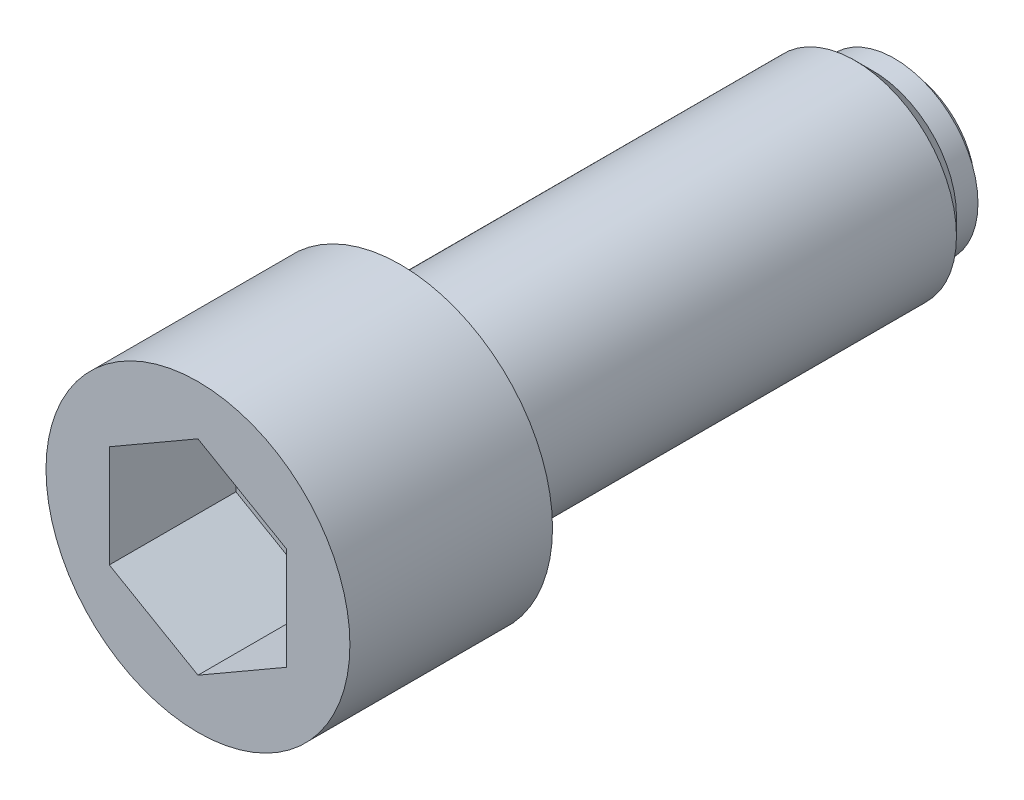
ISO-10303-21;
HEADER;
FILE_DESCRIPTION(('STEP AP214'),'2;1');
FILE_NAME('part.step','',(''),(''),'','','');
FILE_SCHEMA(('AUTOMOTIVE_DESIGN { 1 0 10303 214 1 1 1 1 }'));
ENDSEC;
DATA;
#1=APPLICATION_CONTEXT('core data for automotive mechanical design processes');
#2=APPLICATION_PROTOCOL_DEFINITION('international standard','automotive_design',2000,#1);
#3=PRODUCT_CONTEXT('',#1,'mechanical');
#4=PRODUCT('Part','Part','',(#3));
#5=PRODUCT_RELATED_PRODUCT_CATEGORY('part','',(#4));
#6=PRODUCT_DEFINITION_FORMATION('','',#4);
#7=PRODUCT_DEFINITION_CONTEXT('part definition',#1,'design');
#8=PRODUCT_DEFINITION('design','',#6,#7);
#9=PRODUCT_DEFINITION_SHAPE('','',#8);
#10=(LENGTH_UNIT() NAMED_UNIT(*) SI_UNIT(.MILLI.,.METRE.));
#11=(NAMED_UNIT(*) PLANE_ANGLE_UNIT() SI_UNIT($,.RADIAN.));
#12=(NAMED_UNIT(*) SI_UNIT($,.STERADIAN.) SOLID_ANGLE_UNIT());
#13=UNCERTAINTY_MEASURE_WITH_UNIT(LENGTH_MEASURE(1.E-05),#10,'distance_accuracy_value','');
#14=(GEOMETRIC_REPRESENTATION_CONTEXT(3) GLOBAL_UNCERTAINTY_ASSIGNED_CONTEXT((#13)) GLOBAL_UNIT_ASSIGNED_CONTEXT((#10,
#11,#12)) REPRESENTATION_CONTEXT('',''));
#15=CARTESIAN_POINT('',(0.,0.,0.));
#16=DIRECTION('',(0.,0.,1.));
#17=DIRECTION('',(1.,0.,0.));
#18=AXIS2_PLACEMENT_3D('',#15,#16,#17);
#19=CARTESIAN_POINT('',(0.,0.,2.71615537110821));
#20=DIRECTION('',(0.,0.,1.));
#21=DIRECTION('',(-1.,0.,0.));
#22=AXIS2_PLACEMENT_3D('',#19,#20,#21);
#23=SPHERICAL_SURFACE('',#22,6.);
#24=CARTESIAN_POINT('',(0.,0.,1.));
#25=DIRECTION('',(0.,0.,1.));
#26=DIRECTION('',(1.,0.,0.));
#27=AXIS2_PLACEMENT_3D('',#24,#25,#26);
#28=CIRCLE('',#27,5.74933133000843);
#29=CARTESIAN_POINT('',(-5.74933133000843,0.,1.));
#30=VERTEX_POINT('',#29);
#31=EDGE_CURVE('E132',#30,#30,#28,.T.);
#32=CARTESIAN_POINT('',(0.,0.,0.));
#33=DIRECTION('',(0.,0.,1.));
#34=DIRECTION('',(1.,0.,0.));
#35=AXIS2_PLACEMENT_3D('',#32,#33,#34);
#36=CIRCLE('',#35,5.35);
#37=CARTESIAN_POINT('',(-5.35000000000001,0.,0.));
#38=VERTEX_POINT('',#37);
#39=EDGE_CURVE('E10',#38,#38,#36,.T.);
#40=CARTESIAN_POINT('',(-5.74933133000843,0.,1.));
#41=CARTESIAN_POINT('',(-5.74611879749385,0.,0.989237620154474));
#42=CARTESIAN_POINT('',(-5.74287604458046,0.,0.978484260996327));
#43=CARTESIAN_POINT('',(-5.73633020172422,0.,0.956995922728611));
#44=CARTESIAN_POINT('',(-5.73302711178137,0.,0.946260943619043));
#45=CARTESIAN_POINT('',(-5.72636069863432,0.,0.924809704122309));
#46=CARTESIAN_POINT('',(-5.72299737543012,0.,0.914093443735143));
#47=CARTESIAN_POINT('',(-5.71621060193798,0.,0.892679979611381));
#48=CARTESIAN_POINT('',(-5.71278715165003,0.,0.881982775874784));
#49=CARTESIAN_POINT('',(-5.7058802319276,0.,0.860607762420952));
#50=CARTESIAN_POINT('',(-5.70239676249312,0.,0.849929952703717));
#51=CARTESIAN_POINT('',(-5.69536991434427,0.,0.828594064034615));
#52=CARTESIAN_POINT('',(-5.6918265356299,0.,0.817935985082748));
#53=CARTESIAN_POINT('',(-5.68467998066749,0.,0.796639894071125));
#54=CARTESIAN_POINT('',(-5.68107680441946,0.,0.786001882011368));
#55=CARTESIAN_POINT('',(-5.67381076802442,0.,0.764746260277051));
#56=CARTESIAN_POINT('',(-5.67014790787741,0.,0.75412865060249));
#57=CARTESIAN_POINT('',(-5.66276261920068,0.,0.732914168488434));
#58=CARTESIAN_POINT('',(-5.65904019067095,0.,0.722317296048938));
#59=CARTESIAN_POINT('',(-5.65153588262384,0.,0.701144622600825));
#60=CARTESIAN_POINT('',(-5.64775400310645,0.,0.690568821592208));
#61=CARTESIAN_POINT('',(-5.64013091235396,0.,0.66943862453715));
#62=CARTESIAN_POINT('',(-5.63628970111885,0.,0.658884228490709));
#63=CARTESIAN_POINT('',(-5.628548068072,0.,0.637797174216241));
#64=CARTESIAN_POINT('',(-5.62464764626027,0.,0.627264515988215));
#65=CARTESIAN_POINT('',(-5.61678771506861,0.,0.606221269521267));
#66=CARTESIAN_POINT('',(-5.61282820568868,0.,0.595710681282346));
#67=CARTESIAN_POINT('',(-5.60485022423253,0.,0.574711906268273));
#68=CARTESIAN_POINT('',(-5.6008317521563,0.,0.564223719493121));
#69=CARTESIAN_POINT('',(-5.59273597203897,0.,0.54327007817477));
#70=CARTESIAN_POINT('',(-5.58865866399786,0.,0.532804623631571));
#71=CARTESIAN_POINT('',(-5.58044534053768,0.,0.5118967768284));
#72=CARTESIAN_POINT('',(-5.57630932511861,0.,0.501454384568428));
#73=CARTESIAN_POINT('',(-5.56797871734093,0.,0.480592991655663));
#74=CARTESIAN_POINT('',(-5.56378412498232,0.,0.47017399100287));
#75=CARTESIAN_POINT('',(-5.55533649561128,0.,0.449359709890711));
#76=CARTESIAN_POINT('',(-5.55108345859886,0.,0.438964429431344));
#77=CARTESIAN_POINT('',(-5.54251907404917,0.,0.418197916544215));
#78=CARTESIAN_POINT('',(-5.53820772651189,0.,0.407826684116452));
#79=CARTESIAN_POINT('',(-5.52952685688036,0.,0.387108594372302));
#80=CARTESIAN_POINT('',(-5.52515733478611,0.,0.376761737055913));
#81=CARTESIAN_POINT('',(-5.51636025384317,0.,0.356092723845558));
#82=CARTESIAN_POINT('',(-5.51193269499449,0.,0.345770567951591));
#83=CARTESIAN_POINT('',(-5.50301968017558,0.,0.325151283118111));
#84=CARTESIAN_POINT('',(-5.49853422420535,0.,0.314854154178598));
#85=CARTESIAN_POINT('',(-5.4895055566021,0.,0.294285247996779));
#86=CARTESIAN_POINT('',(-5.48496234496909,0.,0.284013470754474));
#87=CARTESIAN_POINT('',(-5.47581830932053,0.,0.263495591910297));
#88=CARTESIAN_POINT('',(-5.47121748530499,0.,0.253249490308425));
#89=CARTESIAN_POINT('',(-5.4619583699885,0.,0.232783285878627));
#90=CARTESIAN_POINT('',(-5.45730007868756,0.,0.222563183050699));
#91=CARTESIAN_POINT('',(-5.44792617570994,0.,0.202149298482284));
#92=CARTESIAN_POINT('',(-5.44321056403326,0.,0.191955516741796));
#93=CARTESIAN_POINT('',(-5.4337221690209,0.,0.171594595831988));
#94=CARTESIAN_POINT('',(-5.42894938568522,0.,0.161427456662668));
#95=CARTESIAN_POINT('',(-5.41934679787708,0.,0.141120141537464));
#96=CARTESIAN_POINT('',(-5.41451699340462,0.,0.13097996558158));
#97=CARTESIAN_POINT('',(-5.40480051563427,0.,0.110726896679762));
#98=CARTESIAN_POINT('',(-5.39991384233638,0.,0.100614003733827));
#99=CARTESIAN_POINT('',(-5.3900837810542,0.,0.0804158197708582));
#100=CARTESIAN_POINT('',(-5.38514039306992,0.,0.0703305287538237));
#101=CARTESIAN_POINT('',(-5.37519705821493,0.,0.050187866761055));
#102=CARTESIAN_POINT('',(-5.37019711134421,0.,0.0401304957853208));
#103=CARTESIAN_POINT('',(-5.36014081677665,0.,0.0200439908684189));
#104=CARTESIAN_POINT('',(-5.3550844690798,0.,0.0100148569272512));
#105=CARTESIAN_POINT('',(-5.35000000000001,0.,0.));
#106=B_SPLINE_CURVE_WITH_KNOTS('',3,(#40,#41,#42,#43,#44,#45,#46,#47,#48,#49,#50,#51,#52,#53,
#54,#55,#56,#57,#58,#59,#60,#61,#62,#63,#64,#65,#66,#67,#68,#69,#70,#71,#72,#73,#74,#75,#76,#77,
#78,#79,#80,#81,#82,#83,#84,#85,#86,#87,#88,#89,#90,#91,#92,#93,#94,#95,#96,#97,#98,#99,#100,
#101,#102,#103,#104,#105),.UNSPECIFIED.,.F.,.F.,(4,2,2,2,2,2,2,2,2,2,2,2,2,2,2,2,2,2,2,2,2,2,2,
2,2,2,2,2,2,2,2,2,4),(0.,0.033694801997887,0.0673896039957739,0.101084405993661,
0.134779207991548,0.168474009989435,0.202168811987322,0.235863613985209,0.269558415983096,
0.303253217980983,0.33694801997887,0.370642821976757,0.404337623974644,0.438032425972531,
0.471727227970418,0.505422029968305,0.539116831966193,0.572811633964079,0.606506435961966,
0.640201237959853,0.67389603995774,0.707590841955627,0.741285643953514,0.774980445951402,
0.808675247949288,0.842370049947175,0.876064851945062,0.909759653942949,0.943454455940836,
0.977149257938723,1.01084405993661,1.0445388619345,1.07823366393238),.UNSPECIFIED.);
#107=EDGE_CURVE('BSEAM16',#30,#38,#106,.T.);
#108=ORIENTED_EDGE('',*,*,#31,.F.);
#109=ORIENTED_EDGE('',*,*,#39,.T.);
#110=ORIENTED_EDGE('',*,*,#107,.T.);
#111=ORIENTED_EDGE('',*,*,#107,.F.);
#112=EDGE_LOOP('',(#108,#110,#109,#111));
#113=FACE_BOUND('',#112,.T.);
#114=ADVANCED_FACE('F16',(#113),#23,.T.);
#115=CARTESIAN_POINT('',(0.,0.,0.));
#116=DIRECTION('',(0.,0.,1.));
#117=DIRECTION('',(1.,0.,0.));
#118=AXIS2_PLACEMENT_3D('',#115,#116,#117);
#119=PLANE('',#118);
#120=ORIENTED_EDGE('',*,*,#39,.F.);
#121=EDGE_LOOP('',(#120));
#122=FACE_BOUND('',#121,.T.);
#123=ADVANCED_FACE('F209',(#122),#119,.F.);
#124=CARTESIAN_POINT('',(-12.,0.,56.));
#125=DIRECTION('',(0.,0.,-1.));
#126=DIRECTION('',(-1.,0.,0.));
#127=AXIS2_PLACEMENT_3D('',#124,#125,#126);
#128=PLANE('',#127);
#129=DIRECTION('',(-0.866025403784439,-0.5,0.));
#130=VECTOR('',#129,1.);
#131=CARTESIAN_POINT('',(0.,8.08290376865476,56.));
#132=LINE('',#131,#130);
#133=CARTESIAN_POINT('',(0.,8.08290376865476,56.));
#134=VERTEX_POINT('',#133);
#135=CARTESIAN_POINT('',(-7.,4.04145188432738,56.));
#136=VERTEX_POINT('',#135);
#137=EDGE_CURVE('E114',#134,#136,#132,.T.);
#138=ORIENTED_EDGE('',*,*,#137,.F.);
#139=DIRECTION('',(-0.866025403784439,0.5,0.));
#140=VECTOR('',#139,1.);
#141=CARTESIAN_POINT('',(7.,4.04145188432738,56.));
#142=LINE('',#141,#140);
#143=CARTESIAN_POINT('',(7.,4.04145188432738,56.));
#144=VERTEX_POINT('',#143);
#145=EDGE_CURVE('E31',#144,#134,#142,.T.);
#146=ORIENTED_EDGE('',*,*,#145,.F.);
#147=DIRECTION('',(0.,1.,0.));
#148=VECTOR('',#147,1.);
#149=CARTESIAN_POINT('',(7.,-4.04145188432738,56.));
#150=LINE('',#149,#148);
#151=CARTESIAN_POINT('',(7.,-4.04145188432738,56.));
#152=VERTEX_POINT('',#151);
#153=EDGE_CURVE('E126',#152,#144,#150,.T.);
#154=ORIENTED_EDGE('',*,*,#153,.F.);
#155=DIRECTION('',(0.866025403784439,0.5,0.));
#156=VECTOR('',#155,1.);
#157=CARTESIAN_POINT('',(0.,-8.08290376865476,56.));
#158=LINE('',#157,#156);
#159=CARTESIAN_POINT('',(0.,-8.08290376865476,56.));
#160=VERTEX_POINT('',#159);
#161=EDGE_CURVE('E123',#160,#152,#158,.T.);
#162=ORIENTED_EDGE('',*,*,#161,.F.);
#163=DIRECTION('',(0.866025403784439,-0.5,0.));
#164=VECTOR('',#163,1.);
#165=CARTESIAN_POINT('',(-7.,-4.04145188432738,56.));
#166=LINE('',#165,#164);
#167=CARTESIAN_POINT('',(-7.,-4.04145188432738,56.));
#168=VERTEX_POINT('',#167);
#169=EDGE_CURVE('E79',#168,#160,#166,.T.);
#170=ORIENTED_EDGE('',*,*,#169,.F.);
#171=DIRECTION('',(0.,-1.,0.));
#172=VECTOR('',#171,1.);
#173=CARTESIAN_POINT('',(-7.,4.04145188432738,56.));
#174=LINE('',#173,#172);
#175=EDGE_CURVE('E118',#136,#168,#174,.T.);
#176=ORIENTED_EDGE('',*,*,#175,.F.);
#177=EDGE_LOOP('',(#138,#146,#154,#162,#170,#176));
#178=FACE_BOUND('',#177,.T.);
#179=CARTESIAN_POINT('',(0.,0.,56.));
#180=DIRECTION('',(0.,0.,1.));
#181=DIRECTION('',(1.,0.,0.));
#182=AXIS2_PLACEMENT_3D('',#179,#180,#181);
#183=CIRCLE('',#182,12.);
#184=CARTESIAN_POINT('',(12.,0.,56.));
#185=VERTEX_POINT('',#184);
#186=EDGE_CURVE('E24',#185,#185,#183,.T.);
#187=ORIENTED_EDGE('',*,*,#186,.T.);
#188=EDGE_LOOP('',(#187));
#189=FACE_BOUND('',#188,.T.);
#190=ADVANCED_FACE('F168',(#178,#189),#128,.F.);
#191=CARTESIAN_POINT('',(0.,0.,0.));
#192=DIRECTION('',(0.,0.,1.));
#193=DIRECTION('',(1.,0.,0.));
#194=AXIS2_PLACEMENT_3D('',#191,#192,#193);
#195=CYLINDRICAL_SURFACE('',#194,12.);
#196=ORIENTED_EDGE('',*,*,#186,.F.);
#197=EDGE_LOOP('',(#196));
#198=FACE_BOUND('',#197,.T.);
#199=CARTESIAN_POINT('',(0.,0.,40.));
#200=DIRECTION('',(0.,0.,1.));
#201=DIRECTION('',(1.,0.,0.));
#202=AXIS2_PLACEMENT_3D('',#199,#200,#201);
#203=CIRCLE('',#202,12.);
#204=CARTESIAN_POINT('',(12.,0.,40.));
#205=VERTEX_POINT('',#204);
#206=EDGE_CURVE('E161',#205,#205,#203,.T.);
#207=ORIENTED_EDGE('',*,*,#206,.T.);
#208=EDGE_LOOP('',(#207));
#209=FACE_BOUND('',#208,.T.);
#210=ADVANCED_FACE('F170',(#198,#209),#195,.T.);
#211=CARTESIAN_POINT('',(-8.,0.,40.));
#212=DIRECTION('',(0.,0.,1.));
#213=DIRECTION('',(1.,0.,0.));
#214=AXIS2_PLACEMENT_3D('',#211,#212,#213);
#215=PLANE('',#214);
#216=ORIENTED_EDGE('',*,*,#206,.F.);
#217=EDGE_LOOP('',(#216));
#218=FACE_BOUND('',#217,.T.);
#219=CARTESIAN_POINT('',(0.,0.,40.));
#220=DIRECTION('',(0.,0.,1.));
#221=DIRECTION('',(1.,0.,0.));
#222=AXIS2_PLACEMENT_3D('',#219,#220,#221);
#223=CIRCLE('',#222,8.);
#224=CARTESIAN_POINT('',(8.,0.,40.));
#225=VERTEX_POINT('',#224);
#226=EDGE_CURVE('E157',#225,#225,#223,.T.);
#227=ORIENTED_EDGE('',*,*,#226,.T.);
#228=EDGE_LOOP('',(#227));
#229=FACE_BOUND('',#228,.T.);
#230=ADVANCED_FACE('F173',(#218,#229),#215,.F.);
#231=CARTESIAN_POINT('',(0.,0.,0.));
#232=DIRECTION('',(0.,0.,1.));
#233=DIRECTION('',(1.,0.,0.));
#234=AXIS2_PLACEMENT_3D('',#231,#232,#233);
#235=CYLINDRICAL_SURFACE('',#234,8.);
#236=ORIENTED_EDGE('',*,*,#226,.F.);
#237=EDGE_LOOP('',(#236));
#238=FACE_BOUND('',#237,.T.);
#239=CARTESIAN_POINT('',(0.,0.,4.1));
#240=DIRECTION('',(0.,0.,1.));
#241=DIRECTION('',(1.,0.,0.));
#242=AXIS2_PLACEMENT_3D('',#239,#240,#241);
#243=CIRCLE('',#242,8.);
#244=CARTESIAN_POINT('',(8.,0.,4.1));
#245=VERTEX_POINT('',#244);
#246=EDGE_CURVE('E153',#245,#245,#243,.T.);
#247=ORIENTED_EDGE('',*,*,#246,.T.);
#248=EDGE_LOOP('',(#247));
#249=FACE_BOUND('',#248,.T.);
#250=ADVANCED_FACE('F179',(#238,#249),#235,.T.);
#251=CARTESIAN_POINT('',(0.,0.,2.7));
#252=DIRECTION('',(0.,0.,1.));
#253=DIRECTION('',(1.,0.,0.));
#254=AXIS2_PLACEMENT_3D('',#251,#252,#253);
#255=CONICAL_SURFACE('',#254,6.6,0.785398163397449);
#256=ORIENTED_EDGE('',*,*,#246,.F.);
#257=EDGE_LOOP('',(#256));
#258=FACE_BOUND('',#257,.T.);
#259=CARTESIAN_POINT('',(0.,0.,2.7));
#260=DIRECTION('',(0.,0.,1.));
#261=DIRECTION('',(1.,0.,0.));
#262=AXIS2_PLACEMENT_3D('',#259,#260,#261);
#263=CIRCLE('',#262,6.6);
#264=CARTESIAN_POINT('',(6.6,0.,2.7));
#265=VERTEX_POINT('',#264);
#266=EDGE_CURVE('E149',#265,#265,#263,.T.);
#267=ORIENTED_EDGE('',*,*,#266,.T.);
#268=EDGE_LOOP('',(#267));
#269=FACE_BOUND('',#268,.T.);
#270=ADVANCED_FACE('F185',(#258,#269),#255,.T.);
#271=CARTESIAN_POINT('',(0.,0.,0.));
#272=DIRECTION('',(0.,0.,1.));
#273=DIRECTION('',(1.,0.,0.));
#274=AXIS2_PLACEMENT_3D('',#271,#272,#273);
#275=CYLINDRICAL_SURFACE('',#274,6.6);
#276=ORIENTED_EDGE('',*,*,#266,.F.);
#277=EDGE_LOOP('',(#276));
#278=FACE_BOUND('',#277,.T.);
#279=CARTESIAN_POINT('',(0.,0.,1.));
#280=DIRECTION('',(0.,0.,1.));
#281=DIRECTION('',(1.,0.,0.));
#282=AXIS2_PLACEMENT_3D('',#279,#280,#281);
#283=CIRCLE('',#282,6.6);
#284=CARTESIAN_POINT('',(6.6,0.,1.));
#285=VERTEX_POINT('',#284);
#286=EDGE_CURVE('E145',#285,#285,#283,.T.);
#287=ORIENTED_EDGE('',*,*,#286,.T.);
#288=EDGE_LOOP('',(#287));
#289=FACE_BOUND('',#288,.T.);
#290=ADVANCED_FACE('F191',(#278,#289),#275,.T.);
#291=CARTESIAN_POINT('',(-5.74933133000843,0.,1.));
#292=DIRECTION('',(0.,0.,1.));
#293=DIRECTION('',(1.,0.,0.));
#294=AXIS2_PLACEMENT_3D('',#291,#292,#293);
#295=PLANE('',#294);
#296=ORIENTED_EDGE('',*,*,#286,.F.);
#297=EDGE_LOOP('',(#296));
#298=FACE_BOUND('',#297,.T.);
#299=ORIENTED_EDGE('',*,*,#31,.T.);
#300=EDGE_LOOP('',(#299));
#301=FACE_BOUND('',#300,.T.);
#302=ADVANCED_FACE('F197',(#298,#301),#295,.F.);
#303=CARTESIAN_POINT('',(7.,4.04145188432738,46.));
#304=DIRECTION('',(0.5,0.866025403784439,0.));
#305=DIRECTION('',(-0.866025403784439,0.5,0.));
#306=AXIS2_PLACEMENT_3D('',#303,#304,#305);
#307=PLANE('',#306);
#308=ORIENTED_EDGE('',*,*,#145,.T.);
#309=DIRECTION('',(0.,0.,1.));
#310=VECTOR('',#309,1.);
#311=CARTESIAN_POINT('',(0.,8.08290376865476,46.));
#312=LINE('',#311,#310);
#313=CARTESIAN_POINT('',(0.,8.08290376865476,46.));
#314=VERTEX_POINT('',#313);
#315=EDGE_CURVE('E61',#314,#134,#312,.T.);
#316=ORIENTED_EDGE('',*,*,#315,.F.);
#317=DIRECTION('',(-0.866025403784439,0.5,0.));
#318=VECTOR('',#317,1.);
#319=CARTESIAN_POINT('',(7.,4.04145188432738,46.));
#320=LINE('',#319,#318);
#321=CARTESIAN_POINT('',(7.,4.04145188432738,46.));
#322=VERTEX_POINT('',#321);
#323=EDGE_CURVE('E129',#322,#314,#320,.T.);
#324=ORIENTED_EDGE('',*,*,#323,.F.);
#325=DIRECTION('',(0.,0.,1.));
#326=VECTOR('',#325,1.);
#327=CARTESIAN_POINT('',(7.,4.04145188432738,46.));
#328=LINE('',#327,#326);
#329=EDGE_CURVE('E39',#322,#144,#328,.T.);
#330=ORIENTED_EDGE('',*,*,#329,.T.);
#331=EDGE_LOOP('',(#308,#316,#324,#330));
#332=FACE_BOUND('',#331,.T.);
#333=ADVANCED_FACE('F203',(#332),#307,.F.);
#334=CARTESIAN_POINT('',(7.,-4.04145188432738,46.));
#335=DIRECTION('',(1.,0.,0.));
#336=DIRECTION('',(0.,1.,0.));
#337=AXIS2_PLACEMENT_3D('',#334,#335,#336);
#338=PLANE('',#337);
#339=ORIENTED_EDGE('',*,*,#153,.T.);
#340=ORIENTED_EDGE('',*,*,#329,.F.);
#341=DIRECTION('',(0.,1.,0.));
#342=VECTOR('',#341,1.);
#343=CARTESIAN_POINT('',(7.,-4.04145188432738,46.));
#344=LINE('',#343,#342);
#345=CARTESIAN_POINT('',(7.,-4.04145188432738,46.));
#346=VERTEX_POINT('',#345);
#347=EDGE_CURVE('E93',#346,#322,#344,.T.);
#348=ORIENTED_EDGE('',*,*,#347,.F.);
#349=DIRECTION('',(0.,0.,1.));
#350=VECTOR('',#349,1.);
#351=CARTESIAN_POINT('',(7.,-4.04145188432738,46.));
#352=LINE('',#351,#350);
#353=EDGE_CURVE('E84',#346,#152,#352,.T.);
#354=ORIENTED_EDGE('',*,*,#353,.T.);
#355=EDGE_LOOP('',(#339,#340,#348,#354));
#356=FACE_BOUND('',#355,.T.);
#357=ADVANCED_FACE('F223',(#356),#338,.F.);
#358=CARTESIAN_POINT('',(0.,-8.08290376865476,46.));
#359=DIRECTION('',(0.5,-0.866025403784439,0.));
#360=DIRECTION('',(0.866025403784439,0.5,0.));
#361=AXIS2_PLACEMENT_3D('',#358,#359,#360);
#362=PLANE('',#361);
#363=ORIENTED_EDGE('',*,*,#161,.T.);
#364=ORIENTED_EDGE('',*,*,#353,.F.);
#365=DIRECTION('',(0.866025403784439,0.5,0.));
#366=VECTOR('',#365,1.);
#367=CARTESIAN_POINT('',(0.,-8.08290376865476,46.));
#368=LINE('',#367,#366);
#369=CARTESIAN_POINT('',(0.,-8.08290376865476,46.));
#370=VERTEX_POINT('',#369);
#371=EDGE_CURVE('E88',#370,#346,#368,.T.);
#372=ORIENTED_EDGE('',*,*,#371,.F.);
#373=DIRECTION('',(0.,0.,1.));
#374=VECTOR('',#373,1.);
#375=CARTESIAN_POINT('',(0.,-8.08290376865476,46.));
#376=LINE('',#375,#374);
#377=EDGE_CURVE('E72',#370,#160,#376,.T.);
#378=ORIENTED_EDGE('',*,*,#377,.T.);
#379=EDGE_LOOP('',(#363,#364,#372,#378));
#380=FACE_BOUND('',#379,.T.);
#381=ADVANCED_FACE('F89',(#380),#362,.F.);
#382=CARTESIAN_POINT('',(-7.,-4.04145188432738,46.));
#383=DIRECTION('',(-0.5,-0.866025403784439,0.));
#384=DIRECTION('',(0.866025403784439,-0.5,0.));
#385=AXIS2_PLACEMENT_3D('',#382,#383,#384);
#386=PLANE('',#385);
#387=ORIENTED_EDGE('',*,*,#169,.T.);
#388=ORIENTED_EDGE('',*,*,#377,.F.);
#389=DIRECTION('',(0.866025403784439,-0.5,0.));
#390=VECTOR('',#389,1.);
#391=CARTESIAN_POINT('',(-7.,-4.04145188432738,46.));
#392=LINE('',#391,#390);
#393=CARTESIAN_POINT('',(-7.,-4.04145188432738,46.));
#394=VERTEX_POINT('',#393);
#395=EDGE_CURVE('E76',#394,#370,#392,.T.);
#396=ORIENTED_EDGE('',*,*,#395,.F.);
#397=DIRECTION('',(0.,0.,1.));
#398=VECTOR('',#397,1.);
#399=CARTESIAN_POINT('',(-7.,-4.04145188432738,46.));
#400=LINE('',#399,#398);
#401=EDGE_CURVE('E85',#394,#168,#400,.T.);
#402=ORIENTED_EDGE('',*,*,#401,.T.);
#403=EDGE_LOOP('',(#387,#388,#396,#402));
#404=FACE_BOUND('',#403,.T.);
#405=ADVANCED_FACE('F74',(#404),#386,.F.);
#406=CARTESIAN_POINT('',(-7.,4.04145188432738,46.));
#407=DIRECTION('',(-1.,0.,0.));
#408=DIRECTION('',(0.,0.,1.));
#409=AXIS2_PLACEMENT_3D('',#406,#407,#408);
#410=PLANE('',#409);
#411=ORIENTED_EDGE('',*,*,#175,.T.);
#412=ORIENTED_EDGE('',*,*,#401,.F.);
#413=DIRECTION('',(0.,-1.,0.));
#414=VECTOR('',#413,1.);
#415=CARTESIAN_POINT('',(-7.,4.04145188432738,46.));
#416=LINE('',#415,#414);
#417=CARTESIAN_POINT('',(-7.,4.04145188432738,46.));
#418=VERTEX_POINT('',#417);
#419=EDGE_CURVE('E99',#418,#394,#416,.T.);
#420=ORIENTED_EDGE('',*,*,#419,.F.);
#421=DIRECTION('',(0.,0.,1.));
#422=VECTOR('',#421,1.);
#423=CARTESIAN_POINT('',(-7.,4.04145188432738,46.));
#424=LINE('',#423,#422);
#425=EDGE_CURVE('E137',#418,#136,#424,.T.);
#426=ORIENTED_EDGE('',*,*,#425,.T.);
#427=EDGE_LOOP('',(#411,#412,#420,#426));
#428=FACE_BOUND('',#427,.T.);
#429=ADVANCED_FACE('F227',(#428),#410,.F.);
#430=CARTESIAN_POINT('',(0.,8.08290376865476,46.));
#431=DIRECTION('',(-0.5,0.866025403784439,0.));
#432=DIRECTION('',(-0.866025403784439,-0.5,0.));
#433=AXIS2_PLACEMENT_3D('',#430,#431,#432);
#434=PLANE('',#433);
#435=ORIENTED_EDGE('',*,*,#137,.T.);
#436=ORIENTED_EDGE('',*,*,#425,.F.);
#437=DIRECTION('',(-0.866025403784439,-0.5,0.));
#438=VECTOR('',#437,1.);
#439=CARTESIAN_POINT('',(0.,8.08290376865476,46.));
#440=LINE('',#439,#438);
#441=EDGE_CURVE('E106',#314,#418,#440,.T.);
#442=ORIENTED_EDGE('',*,*,#441,.F.);
#443=ORIENTED_EDGE('',*,*,#315,.T.);
#444=EDGE_LOOP('',(#435,#436,#442,#443));
#445=FACE_BOUND('',#444,.T.);
#446=ADVANCED_FACE('F224',(#445),#434,.F.);
#447=CARTESIAN_POINT('',(0.,0.,46.));
#448=DIRECTION('',(0.,0.,1.));
#449=DIRECTION('',(1.,0.,0.));
#450=AXIS2_PLACEMENT_3D('',#447,#448,#449);
#451=PLANE('',#450);
#452=ORIENTED_EDGE('',*,*,#323,.T.);
#453=ORIENTED_EDGE('',*,*,#441,.T.);
#454=ORIENTED_EDGE('',*,*,#419,.T.);
#455=ORIENTED_EDGE('',*,*,#395,.T.);
#456=ORIENTED_EDGE('',*,*,#371,.T.);
#457=ORIENTED_EDGE('',*,*,#347,.T.);
#458=EDGE_LOOP('',(#452,#453,#454,#455,#456,#457));
#459=FACE_BOUND('',#458,.T.);
#460=ADVANCED_FACE('F96',(#459),#451,.T.);
#461=CLOSED_SHELL('',(#114,#123,#190,#210,#230,#250,#270,#290,#302,#333,#357,#381,#405,#429,
#446,#460));
#462=MANIFOLD_SOLID_BREP('B1',#461);
#463=ADVANCED_BREP_SHAPE_REPRESENTATION('',(#18,#462),#14);
#464=SHAPE_DEFINITION_REPRESENTATION(#9,#463);
ENDSEC;
END-ISO-10303-21;
